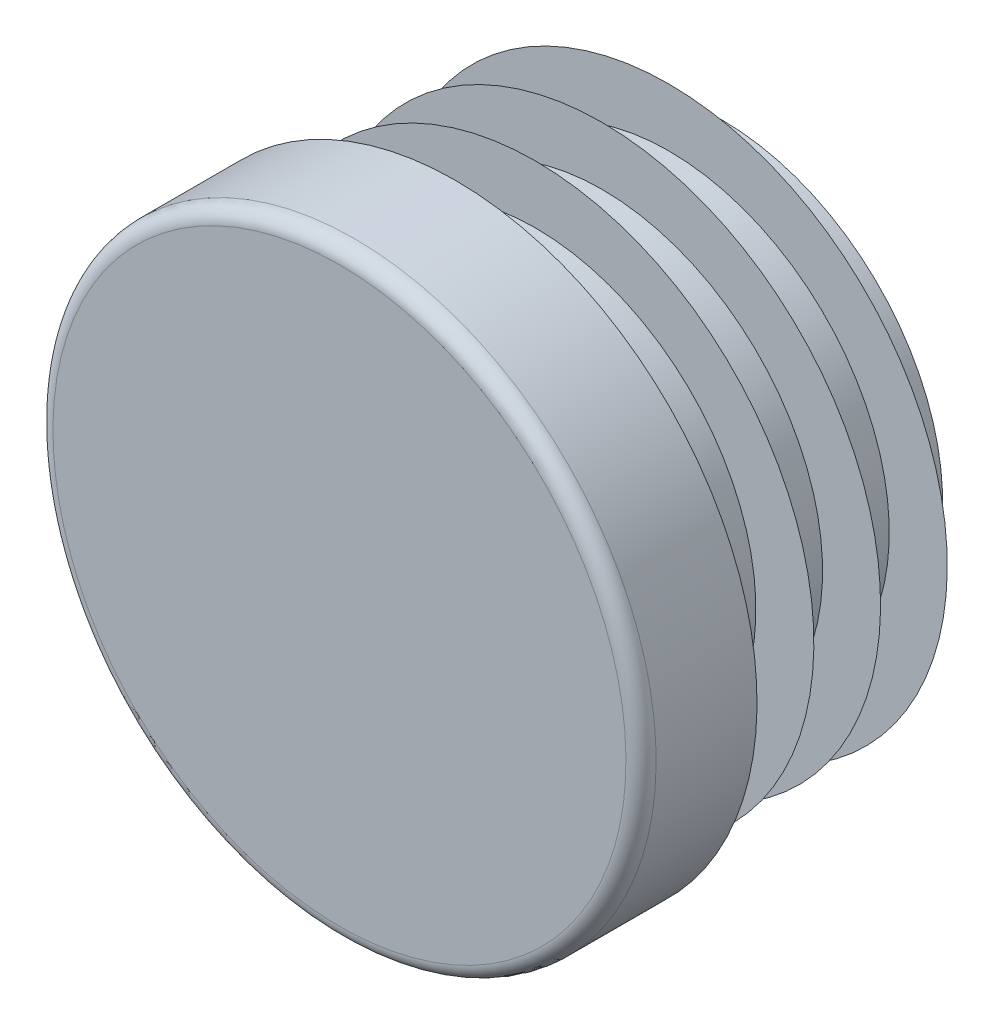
ISO-10303-21;
HEADER;
FILE_DESCRIPTION(('STEP AP214'),'2;1');
FILE_NAME('part.step','',(''),(''),'','','');
FILE_SCHEMA(('AUTOMOTIVE_DESIGN { 1 0 10303 214 1 1 1 1 }'));
ENDSEC;
DATA;
#1=APPLICATION_CONTEXT('core data for automotive mechanical design processes');
#2=APPLICATION_PROTOCOL_DEFINITION('international standard','automotive_design',2000,#1);
#3=PRODUCT_CONTEXT('',#1,'mechanical');
#4=PRODUCT('Part','Part','',(#3));
#5=PRODUCT_RELATED_PRODUCT_CATEGORY('part','',(#4));
#6=PRODUCT_DEFINITION_FORMATION('','',#4);
#7=PRODUCT_DEFINITION_CONTEXT('part definition',#1,'design');
#8=PRODUCT_DEFINITION('design','',#6,#7);
#9=PRODUCT_DEFINITION_SHAPE('','',#8);
#10=(LENGTH_UNIT() NAMED_UNIT(*) SI_UNIT(.MILLI.,.METRE.));
#11=(NAMED_UNIT(*) PLANE_ANGLE_UNIT() SI_UNIT($,.RADIAN.));
#12=(NAMED_UNIT(*) SI_UNIT($,.STERADIAN.) SOLID_ANGLE_UNIT());
#13=UNCERTAINTY_MEASURE_WITH_UNIT(LENGTH_MEASURE(1.E-05),#10,'distance_accuracy_value','');
#14=(GEOMETRIC_REPRESENTATION_CONTEXT(3) GLOBAL_UNCERTAINTY_ASSIGNED_CONTEXT((#13)) GLOBAL_UNIT_ASSIGNED_CONTEXT((#10,
#11,#12)) REPRESENTATION_CONTEXT('',''));
#15=CARTESIAN_POINT('',(0.,0.,0.));
#16=DIRECTION('',(0.,0.,1.));
#17=DIRECTION('',(1.,0.,0.));
#18=AXIS2_PLACEMENT_3D('',#15,#16,#17);
#19=CARTESIAN_POINT('',(0.,0.,5.));
#20=DIRECTION('',(0.,0.,-1.));
#21=DIRECTION('',(0.,1.,0.));
#22=AXIS2_PLACEMENT_3D('',#19,#20,#21);
#23=PLANE('',#22);
#24=CARTESIAN_POINT('',(0.,0.,5.));
#25=DIRECTION('',(0.,0.,-1.));
#26=DIRECTION('',(0.,1.,0.));
#27=AXIS2_PLACEMENT_3D('',#24,#25,#26);
#28=CIRCLE('',#27,12.35);
#29=CARTESIAN_POINT('',(0.,12.35,5.));
#30=VERTEX_POINT('',#29);
#31=EDGE_CURVE('E8',#30,#30,#28,.T.);
#32=ORIENTED_EDGE('',*,*,#31,.F.);
#33=EDGE_LOOP('',(#32));
#34=FACE_BOUND('',#33,.T.);
#35=ADVANCED_FACE('F12',(#34),#23,.F.);
#36=CARTESIAN_POINT('',(0.,0.,4.35));
#37=DIRECTION('',(0.,0.,-1.));
#38=DIRECTION('',(0.,1.,0.));
#39=AXIS2_PLACEMENT_3D('',#36,#37,#38);
#40=TOROIDAL_SURFACE('',#39,12.35,0.65);
#41=ORIENTED_EDGE('',*,*,#31,.T.);
#42=EDGE_LOOP('',(#41));
#43=FACE_BOUND('',#42,.T.);
#44=CARTESIAN_POINT('',(0.,0.,4.35));
#45=DIRECTION('',(0.,0.,-1.));
#46=DIRECTION('',(0.,1.,0.));
#47=AXIS2_PLACEMENT_3D('',#44,#45,#46);
#48=CIRCLE('',#47,13.);
#49=CARTESIAN_POINT('',(0.,13.,4.35));
#50=VERTEX_POINT('',#49);
#51=EDGE_CURVE('E18',#50,#50,#48,.T.);
#52=ORIENTED_EDGE('',*,*,#51,.F.);
#53=EDGE_LOOP('',(#52));
#54=FACE_BOUND('',#53,.T.);
#55=ADVANCED_FACE('F159',(#43,#54),#40,.T.);
#56=CARTESIAN_POINT('',(0.,0.,-11.5));
#57=DIRECTION('',(0.,0.,-1.));
#58=DIRECTION('',(0.,1.,0.));
#59=AXIS2_PLACEMENT_3D('',#56,#57,#58);
#60=CYLINDRICAL_SURFACE('',#59,13.);
#61=CARTESIAN_POINT('',(0.,0.,0.));
#62=DIRECTION('',(0.,0.,-1.));
#63=DIRECTION('',(0.,1.,0.));
#64=AXIS2_PLACEMENT_3D('',#61,#62,#63);
#65=CIRCLE('',#64,13.);
#66=CARTESIAN_POINT('',(0.,13.,0.));
#67=VERTEX_POINT('',#66);
#68=EDGE_CURVE('E22',#67,#67,#65,.T.);
#69=ORIENTED_EDGE('',*,*,#68,.F.);
#70=EDGE_LOOP('',(#69));
#71=FACE_BOUND('',#70,.T.);
#72=ORIENTED_EDGE('',*,*,#51,.T.);
#73=EDGE_LOOP('',(#72));
#74=FACE_BOUND('',#73,.T.);
#75=ADVANCED_FACE('F154',(#71,#74),#60,.T.);
#76=CARTESIAN_POINT('',(13.,0.,0.));
#77=DIRECTION('',(0.,0.,1.));
#78=DIRECTION('',(0.,-1.,0.));
#79=AXIS2_PLACEMENT_3D('',#76,#77,#78);
#80=PLANE('',#79);
#81=CARTESIAN_POINT('',(0.,0.,0.));
#82=DIRECTION('',(0.,0.,-1.));
#83=DIRECTION('',(0.,1.,0.));
#84=AXIS2_PLACEMENT_3D('',#81,#82,#83);
#85=CIRCLE('',#84,9.5);
#86=CARTESIAN_POINT('',(0.,9.5,0.));
#87=VERTEX_POINT('',#86);
#88=EDGE_CURVE('E26',#87,#87,#85,.T.);
#89=ORIENTED_EDGE('',*,*,#88,.F.);
#90=EDGE_LOOP('',(#89));
#91=FACE_BOUND('',#90,.T.);
#92=ORIENTED_EDGE('',*,*,#68,.T.);
#93=EDGE_LOOP('',(#92));
#94=FACE_BOUND('',#93,.T.);
#95=ADVANCED_FACE('F148',(#91,#94),#80,.F.);
#96=CARTESIAN_POINT('',(0.,0.,-11.5));
#97=DIRECTION('',(0.,0.,-1.));
#98=DIRECTION('',(0.,1.,0.));
#99=AXIS2_PLACEMENT_3D('',#96,#97,#98);
#100=CYLINDRICAL_SURFACE('',#99,9.5);
#101=CARTESIAN_POINT('',(0.,0.,-0.575));
#102=DIRECTION('',(0.,0.,-1.));
#103=DIRECTION('',(0.,1.,0.));
#104=AXIS2_PLACEMENT_3D('',#101,#102,#103);
#105=CIRCLE('',#104,9.5);
#106=CARTESIAN_POINT('',(0.,9.5,-0.575));
#107=VERTEX_POINT('',#106);
#108=EDGE_CURVE('E31',#107,#107,#105,.T.);
#109=ORIENTED_EDGE('',*,*,#108,.F.);
#110=EDGE_LOOP('',(#109));
#111=FACE_BOUND('',#110,.T.);
#112=ORIENTED_EDGE('',*,*,#88,.T.);
#113=EDGE_LOOP('',(#112));
#114=FACE_BOUND('',#113,.T.);
#115=ADVANCED_FACE('F142',(#111,#114),#100,.T.);
#116=CARTESIAN_POINT('',(9.5,0.,-0.575));
#117=DIRECTION('',(0.,0.,-1.));
#118=DIRECTION('',(0.,1.,0.));
#119=AXIS2_PLACEMENT_3D('',#116,#117,#118);
#120=PLANE('',#119);
#121=CARTESIAN_POINT('',(0.,0.,-0.575));
#122=DIRECTION('',(0.,0.,-1.));
#123=DIRECTION('',(0.,1.,0.));
#124=AXIS2_PLACEMENT_3D('',#121,#122,#123);
#125=CIRCLE('',#124,12.);
#126=CARTESIAN_POINT('',(0.,12.,-0.575));
#127=VERTEX_POINT('',#126);
#128=EDGE_CURVE('E34',#127,#127,#125,.T.);
#129=ORIENTED_EDGE('',*,*,#128,.F.);
#130=EDGE_LOOP('',(#129));
#131=FACE_BOUND('',#130,.T.);
#132=ORIENTED_EDGE('',*,*,#108,.T.);
#133=EDGE_LOOP('',(#132));
#134=FACE_BOUND('',#133,.T.);
#135=ADVANCED_FACE('F136',(#131,#134),#120,.F.);
#136=CARTESIAN_POINT('',(0.,0.,-0.575));
#137=DIRECTION('',(0.,0.,1.));
#138=DIRECTION('',(0.,-1.,0.));
#139=AXIS2_PLACEMENT_3D('',#136,#137,#138);
#140=CONICAL_SURFACE('',#139,12.,0.959931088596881);
#141=CARTESIAN_POINT('',(0.,0.,-2.32551884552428));
#142=DIRECTION('',(0.,0.,-1.));
#143=DIRECTION('',(0.,1.,0.));
#144=AXIS2_PLACEMENT_3D('',#141,#142,#143);
#145=CIRCLE('',#144,9.5);
#146=CARTESIAN_POINT('',(0.,9.5,-2.32551884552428));
#147=VERTEX_POINT('',#146);
#148=EDGE_CURVE('E37',#147,#147,#145,.T.);
#149=ORIENTED_EDGE('',*,*,#148,.F.);
#150=EDGE_LOOP('',(#149));
#151=FACE_BOUND('',#150,.T.);
#152=ORIENTED_EDGE('',*,*,#128,.T.);
#153=EDGE_LOOP('',(#152));
#154=FACE_BOUND('',#153,.T.);
#155=ADVANCED_FACE('F130',(#151,#154),#140,.T.);
#156=CARTESIAN_POINT('',(0.,0.,-11.5));
#157=DIRECTION('',(0.,0.,-1.));
#158=DIRECTION('',(0.,1.,0.));
#159=AXIS2_PLACEMENT_3D('',#156,#157,#158);
#160=CYLINDRICAL_SURFACE('',#159,9.5);
#161=CARTESIAN_POINT('',(0.,0.,-3.45));
#162=DIRECTION('',(0.,0.,-1.));
#163=DIRECTION('',(0.,1.,0.));
#164=AXIS2_PLACEMENT_3D('',#161,#162,#163);
#165=CIRCLE('',#164,9.5);
#166=CARTESIAN_POINT('',(0.,9.5,-3.45));
#167=VERTEX_POINT('',#166);
#168=EDGE_CURVE('E40',#167,#167,#165,.T.);
#169=ORIENTED_EDGE('',*,*,#168,.F.);
#170=EDGE_LOOP('',(#169));
#171=FACE_BOUND('',#170,.T.);
#172=ORIENTED_EDGE('',*,*,#148,.T.);
#173=EDGE_LOOP('',(#172));
#174=FACE_BOUND('',#173,.T.);
#175=ADVANCED_FACE('F124',(#171,#174),#160,.T.);
#176=CARTESIAN_POINT('',(9.5,0.,-3.45));
#177=DIRECTION('',(0.,0.,-1.));
#178=DIRECTION('',(0.,1.,0.));
#179=AXIS2_PLACEMENT_3D('',#176,#177,#178);
#180=PLANE('',#179);
#181=CARTESIAN_POINT('',(0.,0.,-3.45));
#182=DIRECTION('',(0.,0.,-1.));
#183=DIRECTION('',(0.,1.,0.));
#184=AXIS2_PLACEMENT_3D('',#181,#182,#183);
#185=CIRCLE('',#184,12.);
#186=CARTESIAN_POINT('',(0.,12.,-3.45));
#187=VERTEX_POINT('',#186);
#188=EDGE_CURVE('E43',#187,#187,#185,.T.);
#189=ORIENTED_EDGE('',*,*,#188,.F.);
#190=EDGE_LOOP('',(#189));
#191=FACE_BOUND('',#190,.T.);
#192=ORIENTED_EDGE('',*,*,#168,.T.);
#193=EDGE_LOOP('',(#192));
#194=FACE_BOUND('',#193,.T.);
#195=ADVANCED_FACE('F118',(#191,#194),#180,.F.);
#196=CARTESIAN_POINT('',(0.,0.,-3.45));
#197=DIRECTION('',(0.,0.,1.));
#198=DIRECTION('',(0.,-1.,0.));
#199=AXIS2_PLACEMENT_3D('',#196,#197,#198);
#200=CONICAL_SURFACE('',#199,12.,0.959931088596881);
#201=CARTESIAN_POINT('',(0.,0.,-5.20051884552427));
#202=DIRECTION('',(0.,0.,-1.));
#203=DIRECTION('',(0.,1.,0.));
#204=AXIS2_PLACEMENT_3D('',#201,#202,#203);
#205=CIRCLE('',#204,9.5);
#206=CARTESIAN_POINT('',(0.,9.5,-5.20051884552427));
#207=VERTEX_POINT('',#206);
#208=EDGE_CURVE('E46',#207,#207,#205,.T.);
#209=ORIENTED_EDGE('',*,*,#208,.F.);
#210=EDGE_LOOP('',(#209));
#211=FACE_BOUND('',#210,.T.);
#212=ORIENTED_EDGE('',*,*,#188,.T.);
#213=EDGE_LOOP('',(#212));
#214=FACE_BOUND('',#213,.T.);
#215=ADVANCED_FACE('F112',(#211,#214),#200,.T.);
#216=CARTESIAN_POINT('',(0.,0.,-11.5));
#217=DIRECTION('',(0.,0.,-1.));
#218=DIRECTION('',(0.,1.,0.));
#219=AXIS2_PLACEMENT_3D('',#216,#217,#218);
#220=CYLINDRICAL_SURFACE('',#219,9.5);
#221=CARTESIAN_POINT('',(0.,0.,-6.325));
#222=DIRECTION('',(0.,0.,-1.));
#223=DIRECTION('',(0.,1.,0.));
#224=AXIS2_PLACEMENT_3D('',#221,#222,#223);
#225=CIRCLE('',#224,9.5);
#226=CARTESIAN_POINT('',(0.,9.5,-6.325));
#227=VERTEX_POINT('',#226);
#228=EDGE_CURVE('E49',#227,#227,#225,.T.);
#229=ORIENTED_EDGE('',*,*,#228,.F.);
#230=EDGE_LOOP('',(#229));
#231=FACE_BOUND('',#230,.T.);
#232=ORIENTED_EDGE('',*,*,#208,.T.);
#233=EDGE_LOOP('',(#232));
#234=FACE_BOUND('',#233,.T.);
#235=ADVANCED_FACE('F106',(#231,#234),#220,.T.);
#236=CARTESIAN_POINT('',(9.5,0.,-6.325));
#237=DIRECTION('',(0.,0.,-1.));
#238=DIRECTION('',(0.,1.,0.));
#239=AXIS2_PLACEMENT_3D('',#236,#237,#238);
#240=PLANE('',#239);
#241=CARTESIAN_POINT('',(0.,0.,-6.325));
#242=DIRECTION('',(0.,0.,-1.));
#243=DIRECTION('',(0.,1.,0.));
#244=AXIS2_PLACEMENT_3D('',#241,#242,#243);
#245=CIRCLE('',#244,12.);
#246=CARTESIAN_POINT('',(0.,12.,-6.325));
#247=VERTEX_POINT('',#246);
#248=EDGE_CURVE('E52',#247,#247,#245,.T.);
#249=ORIENTED_EDGE('',*,*,#248,.F.);
#250=EDGE_LOOP('',(#249));
#251=FACE_BOUND('',#250,.T.);
#252=ORIENTED_EDGE('',*,*,#228,.T.);
#253=EDGE_LOOP('',(#252));
#254=FACE_BOUND('',#253,.T.);
#255=ADVANCED_FACE('F100',(#251,#254),#240,.F.);
#256=CARTESIAN_POINT('',(0.,0.,-6.325));
#257=DIRECTION('',(0.,0.,1.));
#258=DIRECTION('',(0.,-1.,0.));
#259=AXIS2_PLACEMENT_3D('',#256,#257,#258);
#260=CONICAL_SURFACE('',#259,12.,0.959931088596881);
#261=CARTESIAN_POINT('',(0.,0.,-8.07551884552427));
#262=DIRECTION('',(0.,0.,-1.));
#263=DIRECTION('',(0.,1.,0.));
#264=AXIS2_PLACEMENT_3D('',#261,#262,#263);
#265=CIRCLE('',#264,9.5);
#266=CARTESIAN_POINT('',(0.,9.5,-8.07551884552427));
#267=VERTEX_POINT('',#266);
#268=EDGE_CURVE('E55',#267,#267,#265,.T.);
#269=ORIENTED_EDGE('',*,*,#268,.F.);
#270=EDGE_LOOP('',(#269));
#271=FACE_BOUND('',#270,.T.);
#272=ORIENTED_EDGE('',*,*,#248,.T.);
#273=EDGE_LOOP('',(#272));
#274=FACE_BOUND('',#273,.T.);
#275=ADVANCED_FACE('F94',(#271,#274),#260,.T.);
#276=CARTESIAN_POINT('',(0.,0.,-11.5));
#277=DIRECTION('',(0.,0.,-1.));
#278=DIRECTION('',(0.,1.,0.));
#279=AXIS2_PLACEMENT_3D('',#276,#277,#278);
#280=CYLINDRICAL_SURFACE('',#279,9.5);
#281=CARTESIAN_POINT('',(0.,0.,-9.2));
#282=DIRECTION('',(0.,0.,-1.));
#283=DIRECTION('',(0.,1.,0.));
#284=AXIS2_PLACEMENT_3D('',#281,#282,#283);
#285=CIRCLE('',#284,9.5);
#286=CARTESIAN_POINT('',(0.,9.5,-9.2));
#287=VERTEX_POINT('',#286);
#288=EDGE_CURVE('E58',#287,#287,#285,.T.);
#289=ORIENTED_EDGE('',*,*,#288,.F.);
#290=EDGE_LOOP('',(#289));
#291=FACE_BOUND('',#290,.T.);
#292=ORIENTED_EDGE('',*,*,#268,.T.);
#293=EDGE_LOOP('',(#292));
#294=FACE_BOUND('',#293,.T.);
#295=ADVANCED_FACE('F88',(#291,#294),#280,.T.);
#296=CARTESIAN_POINT('',(9.5,0.,-9.2));
#297=DIRECTION('',(0.,0.,-1.));
#298=DIRECTION('',(0.,1.,0.));
#299=AXIS2_PLACEMENT_3D('',#296,#297,#298);
#300=PLANE('',#299);
#301=CARTESIAN_POINT('',(0.,0.,-9.2));
#302=DIRECTION('',(0.,0.,-1.));
#303=DIRECTION('',(0.,1.,0.));
#304=AXIS2_PLACEMENT_3D('',#301,#302,#303);
#305=CIRCLE('',#304,12.);
#306=CARTESIAN_POINT('',(0.,12.,-9.2));
#307=VERTEX_POINT('',#306);
#308=EDGE_CURVE('E61',#307,#307,#305,.T.);
#309=ORIENTED_EDGE('',*,*,#308,.F.);
#310=EDGE_LOOP('',(#309));
#311=FACE_BOUND('',#310,.T.);
#312=ORIENTED_EDGE('',*,*,#288,.T.);
#313=EDGE_LOOP('',(#312));
#314=FACE_BOUND('',#313,.T.);
#315=ADVANCED_FACE('F82',(#311,#314),#300,.F.);
#316=CARTESIAN_POINT('',(0.,0.,-9.2));
#317=DIRECTION('',(0.,0.,1.));
#318=DIRECTION('',(0.,-1.,0.));
#319=AXIS2_PLACEMENT_3D('',#316,#317,#318);
#320=CONICAL_SURFACE('',#319,12.,0.959931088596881);
#321=CARTESIAN_POINT('',(0.,0.,-10.9505188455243));
#322=DIRECTION('',(0.,0.,-1.));
#323=DIRECTION('',(0.,1.,0.));
#324=AXIS2_PLACEMENT_3D('',#321,#322,#323);
#325=CIRCLE('',#324,9.5);
#326=CARTESIAN_POINT('',(0.,9.5,-10.9505188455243));
#327=VERTEX_POINT('',#326);
#328=EDGE_CURVE('E64',#327,#327,#325,.T.);
#329=ORIENTED_EDGE('',*,*,#328,.F.);
#330=EDGE_LOOP('',(#329));
#331=FACE_BOUND('',#330,.T.);
#332=ORIENTED_EDGE('',*,*,#308,.T.);
#333=EDGE_LOOP('',(#332));
#334=FACE_BOUND('',#333,.T.);
#335=ADVANCED_FACE('F76',(#331,#334),#320,.T.);
#336=CARTESIAN_POINT('',(0.,0.,-11.5));
#337=DIRECTION('',(0.,0.,-1.));
#338=DIRECTION('',(0.,1.,0.));
#339=AXIS2_PLACEMENT_3D('',#336,#337,#338);
#340=CYLINDRICAL_SURFACE('',#339,9.5);
#341=CARTESIAN_POINT('',(0.,0.,-11.5));
#342=DIRECTION('',(0.,0.,-1.));
#343=DIRECTION('',(0.,1.,0.));
#344=AXIS2_PLACEMENT_3D('',#341,#342,#343);
#345=CIRCLE('',#344,9.5);
#346=CARTESIAN_POINT('',(0.,9.5,-11.5));
#347=VERTEX_POINT('',#346);
#348=EDGE_CURVE('E67',#347,#347,#345,.T.);
#349=ORIENTED_EDGE('',*,*,#348,.F.);
#350=EDGE_LOOP('',(#349));
#351=FACE_BOUND('',#350,.T.);
#352=ORIENTED_EDGE('',*,*,#328,.T.);
#353=EDGE_LOOP('',(#352));
#354=FACE_BOUND('',#353,.T.);
#355=ADVANCED_FACE('F73',(#351,#354),#340,.T.);
#356=CARTESIAN_POINT('',(9.5,0.,-11.5));
#357=DIRECTION('',(0.,0.,1.));
#358=DIRECTION('',(0.,-1.,0.));
#359=AXIS2_PLACEMENT_3D('',#356,#357,#358);
#360=PLANE('',#359);
#361=ORIENTED_EDGE('',*,*,#348,.T.);
#362=EDGE_LOOP('',(#361));
#363=FACE_BOUND('',#362,.T.);
#364=ADVANCED_FACE('F71',(#363),#360,.F.);
#365=CLOSED_SHELL('',(#35,#55,#75,#95,#115,#135,#155,#175,#195,#215,#235,#255,#275,#295,#315,
#335,#355,#364));
#366=MANIFOLD_SOLID_BREP('B1',#365);
#367=ADVANCED_BREP_SHAPE_REPRESENTATION('',(#18,#366),#14);
#368=SHAPE_DEFINITION_REPRESENTATION(#9,#367);
ENDSEC;
END-ISO-10303-21;
